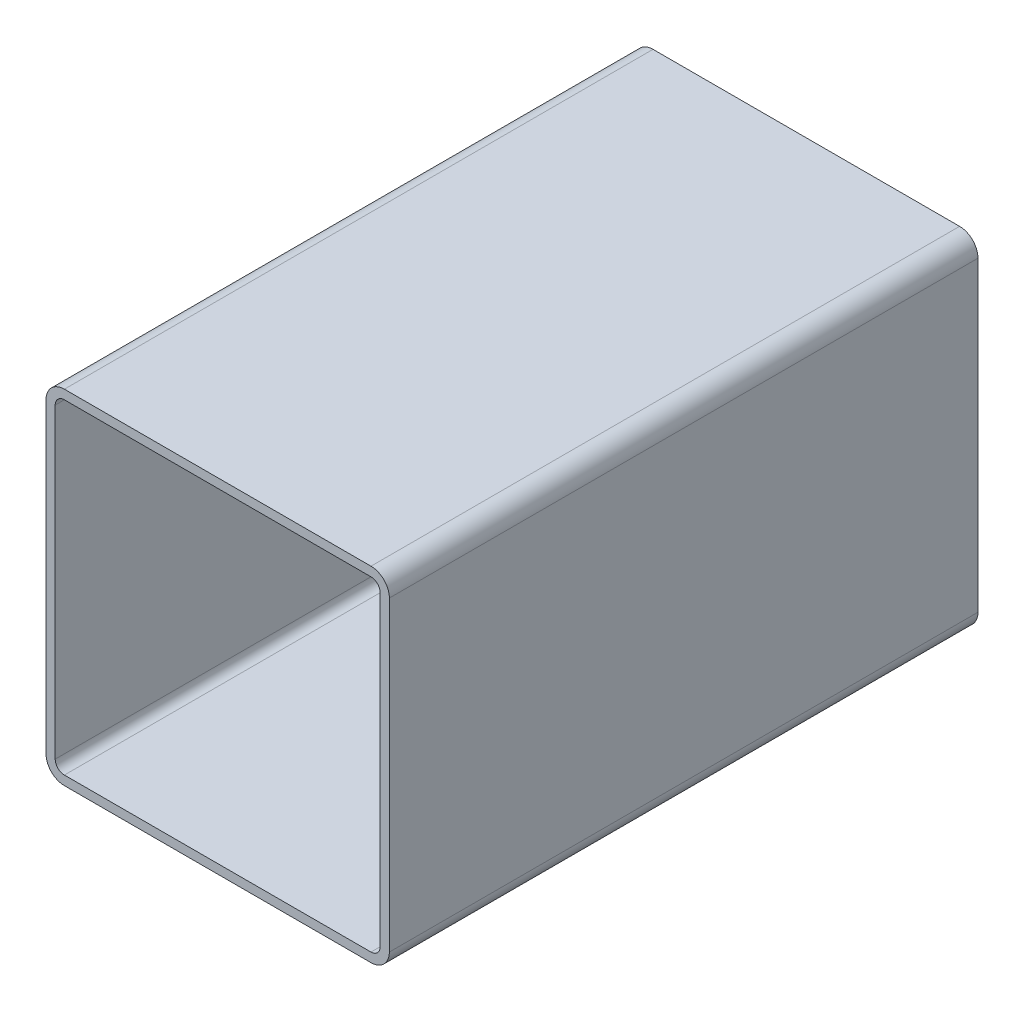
ISO-10303-21;
HEADER;
FILE_DESCRIPTION(('STEP AP214'),'2;1');
FILE_NAME('part.step','',(''),(''),'','','');
FILE_SCHEMA(('AUTOMOTIVE_DESIGN { 1 0 10303 214 1 1 1 1 }'));
ENDSEC;
DATA;
#1=APPLICATION_CONTEXT('core data for automotive mechanical design processes');
#2=APPLICATION_PROTOCOL_DEFINITION('international standard','automotive_design',2000,#1);
#3=PRODUCT_CONTEXT('',#1,'mechanical');
#4=PRODUCT('Part','Part','',(#3));
#5=PRODUCT_RELATED_PRODUCT_CATEGORY('part','',(#4));
#6=PRODUCT_DEFINITION_FORMATION('','',#4);
#7=PRODUCT_DEFINITION_CONTEXT('part definition',#1,'design');
#8=PRODUCT_DEFINITION('design','',#6,#7);
#9=PRODUCT_DEFINITION_SHAPE('','',#8);
#10=(LENGTH_UNIT() NAMED_UNIT(*) SI_UNIT(.MILLI.,.METRE.));
#11=(NAMED_UNIT(*) PLANE_ANGLE_UNIT() SI_UNIT($,.RADIAN.));
#12=(NAMED_UNIT(*) SI_UNIT($,.STERADIAN.) SOLID_ANGLE_UNIT());
#13=UNCERTAINTY_MEASURE_WITH_UNIT(LENGTH_MEASURE(1.E-05),#10,'distance_accuracy_value','');
#14=(GEOMETRIC_REPRESENTATION_CONTEXT(3) GLOBAL_UNCERTAINTY_ASSIGNED_CONTEXT((#13)) GLOBAL_UNIT_ASSIGNED_CONTEXT((#10,
#11,#12)) REPRESENTATION_CONTEXT('',''));
#15=CARTESIAN_POINT('',(0.,0.,0.));
#16=DIRECTION('',(0.,0.,1.));
#17=DIRECTION('',(1.,0.,0.));
#18=AXIS2_PLACEMENT_3D('',#15,#16,#17);
#19=CARTESIAN_POINT('',(11.7298786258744,170.264039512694,304.8));
#20=DIRECTION('',(0.,0.,1.));
#21=DIRECTION('',(1.,0.,0.));
#22=AXIS2_PLACEMENT_3D('',#19,#20,#21);
#23=PLANE('',#22);
#24=CARTESIAN_POINT('',(11.7298786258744,170.264039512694,304.8));
#25=DIRECTION('',(0.,0.,1.));
#26=DIRECTION('',(1.,0.,0.));
#27=AXIS2_PLACEMENT_3D('',#24,#25,#26);
#28=CIRCLE('',#27,9.525);
#29=CARTESIAN_POINT('',(11.7298786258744,179.789039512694,304.8));
#30=VERTEX_POINT('',#29);
#31=CARTESIAN_POINT('',(2.20487862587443,170.264039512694,304.8));
#32=VERTEX_POINT('',#31);
#33=EDGE_CURVE('E211',#30,#32,#28,.T.);
#34=ORIENTED_EDGE('',*,*,#33,.T.);
#35=DIRECTION('',(0.,-1.,0.));
#36=VECTOR('',#35,1.);
#37=CARTESIAN_POINT('',(2.20487862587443,11.5140395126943,304.8));
#38=LINE('',#37,#36);
#39=CARTESIAN_POINT('',(2.20487862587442,11.5140395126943,304.8));
#40=VERTEX_POINT('',#39);
#41=EDGE_CURVE('E214',#32,#40,#38,.T.);
#42=ORIENTED_EDGE('',*,*,#41,.T.);
#43=CARTESIAN_POINT('',(11.7298786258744,11.5140395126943,304.8));
#44=DIRECTION('',(0.,0.,1.));
#45=DIRECTION('',(1.,0.,0.));
#46=AXIS2_PLACEMENT_3D('',#43,#44,#45);
#47=CIRCLE('',#46,9.525);
#48=CARTESIAN_POINT('',(11.7298786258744,1.98903951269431,304.8));
#49=VERTEX_POINT('',#48);
#50=EDGE_CURVE('E217',#40,#49,#47,.T.);
#51=ORIENTED_EDGE('',*,*,#50,.T.);
#52=DIRECTION('',(1.,0.,0.));
#53=VECTOR('',#52,1.);
#54=CARTESIAN_POINT('',(170.479878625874,1.98903951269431,304.8));
#55=LINE('',#54,#53);
#56=CARTESIAN_POINT('',(170.479878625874,1.98903951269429,304.8));
#57=VERTEX_POINT('',#56);
#58=EDGE_CURVE('E219',#49,#57,#55,.T.);
#59=ORIENTED_EDGE('',*,*,#58,.T.);
#60=CARTESIAN_POINT('',(170.479878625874,11.5140395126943,304.8));
#61=DIRECTION('',(0.,0.,1.));
#62=DIRECTION('',(1.,0.,0.));
#63=AXIS2_PLACEMENT_3D('',#60,#61,#62);
#64=CIRCLE('',#63,9.52500000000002);
#65=CARTESIAN_POINT('',(180.004878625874,11.5140395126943,304.8));
#66=VERTEX_POINT('',#65);
#67=EDGE_CURVE('E221',#57,#66,#64,.T.);
#68=ORIENTED_EDGE('',*,*,#67,.T.);
#69=DIRECTION('',(0.,1.,0.));
#70=VECTOR('',#69,1.);
#71=CARTESIAN_POINT('',(180.004878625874,170.264039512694,304.8));
#72=LINE('',#71,#70);
#73=CARTESIAN_POINT('',(180.004878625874,170.264039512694,304.8));
#74=VERTEX_POINT('',#73);
#75=EDGE_CURVE('E223',#66,#74,#72,.T.);
#76=ORIENTED_EDGE('',*,*,#75,.T.);
#77=CARTESIAN_POINT('',(170.479878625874,170.264039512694,304.8));
#78=DIRECTION('',(0.,0.,1.));
#79=DIRECTION('',(1.,0.,0.));
#80=AXIS2_PLACEMENT_3D('',#77,#78,#79);
#81=CIRCLE('',#80,9.52500000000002);
#82=CARTESIAN_POINT('',(170.479878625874,179.789039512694,304.8));
#83=VERTEX_POINT('',#82);
#84=EDGE_CURVE('E225',#74,#83,#81,.T.);
#85=ORIENTED_EDGE('',*,*,#84,.T.);
#86=DIRECTION('',(-1.,0.,0.));
#87=VECTOR('',#86,1.);
#88=CARTESIAN_POINT('',(11.7298786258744,179.789039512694,304.8));
#89=LINE('',#88,#87);
#90=EDGE_CURVE('E227',#83,#30,#89,.T.);
#91=ORIENTED_EDGE('',*,*,#90,.T.);
#92=EDGE_LOOP('',(#34,#42,#51,#59,#68,#76,#85,#91));
#93=FACE_BOUND('',#92,.T.);
#94=DIRECTION('',(0.,-1.,0.));
#95=VECTOR('',#94,1.);
#96=CARTESIAN_POINT('',(6.96737862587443,11.5140395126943,304.8));
#97=LINE('',#96,#95);
#98=CARTESIAN_POINT('',(6.96737862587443,170.264039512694,304.8));
#99=VERTEX_POINT('',#98);
#100=CARTESIAN_POINT('',(6.96737862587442,11.5140395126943,304.8));
#101=VERTEX_POINT('',#100);
#102=EDGE_CURVE('E154',#99,#101,#97,.T.);
#103=ORIENTED_EDGE('',*,*,#102,.F.);
#104=CARTESIAN_POINT('',(11.7298786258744,170.264039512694,304.8));
#105=DIRECTION('',(0.,0.,1.));
#106=DIRECTION('',(1.,0.,0.));
#107=AXIS2_PLACEMENT_3D('',#104,#105,#106);
#108=CIRCLE('',#107,4.7625);
#109=CARTESIAN_POINT('',(11.7298786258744,175.026539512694,304.8));
#110=VERTEX_POINT('',#109);
#111=EDGE_CURVE('E146',#110,#99,#108,.T.);
#112=ORIENTED_EDGE('',*,*,#111,.F.);
#113=DIRECTION('',(-1.,0.,0.));
#114=VECTOR('',#113,1.);
#115=CARTESIAN_POINT('',(11.7298786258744,175.026539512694,304.8));
#116=LINE('',#115,#114);
#117=CARTESIAN_POINT('',(170.479878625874,175.026539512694,304.8));
#118=VERTEX_POINT('',#117);
#119=EDGE_CURVE('E179',#118,#110,#116,.T.);
#120=ORIENTED_EDGE('',*,*,#119,.F.);
#121=CARTESIAN_POINT('',(170.479878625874,170.264039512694,304.8));
#122=DIRECTION('',(0.,0.,1.));
#123=DIRECTION('',(1.,0.,0.));
#124=AXIS2_PLACEMENT_3D('',#121,#122,#123);
#125=CIRCLE('',#124,4.7625);
#126=CARTESIAN_POINT('',(175.242378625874,170.264039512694,304.8));
#127=VERTEX_POINT('',#126);
#128=EDGE_CURVE('E177',#127,#118,#125,.T.);
#129=ORIENTED_EDGE('',*,*,#128,.F.);
#130=DIRECTION('',(0.,1.,0.));
#131=VECTOR('',#130,1.);
#132=CARTESIAN_POINT('',(175.242378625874,170.264039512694,304.8));
#133=LINE('',#132,#131);
#134=CARTESIAN_POINT('',(175.242378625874,11.5140395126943,304.8));
#135=VERTEX_POINT('',#134);
#136=EDGE_CURVE('E175',#135,#127,#133,.T.);
#137=ORIENTED_EDGE('',*,*,#136,.F.);
#138=CARTESIAN_POINT('',(170.479878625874,11.5140395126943,304.8));
#139=DIRECTION('',(0.,0.,1.));
#140=DIRECTION('',(1.,0.,0.));
#141=AXIS2_PLACEMENT_3D('',#138,#139,#140);
#142=CIRCLE('',#141,4.7625);
#143=CARTESIAN_POINT('',(170.479878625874,6.75153951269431,304.8));
#144=VERTEX_POINT('',#143);
#145=EDGE_CURVE('E173',#144,#135,#142,.T.);
#146=ORIENTED_EDGE('',*,*,#145,.F.);
#147=DIRECTION('',(1.,0.,0.));
#148=VECTOR('',#147,1.);
#149=CARTESIAN_POINT('',(170.479878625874,6.75153951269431,304.8));
#150=LINE('',#149,#148);
#151=CARTESIAN_POINT('',(11.7298786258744,6.75153951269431,304.8));
#152=VERTEX_POINT('',#151);
#153=EDGE_CURVE('E169',#152,#144,#150,.T.);
#154=ORIENTED_EDGE('',*,*,#153,.F.);
#155=CARTESIAN_POINT('',(11.7298786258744,11.5140395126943,304.8));
#156=DIRECTION('',(0.,0.,1.));
#157=DIRECTION('',(1.,0.,0.));
#158=AXIS2_PLACEMENT_3D('',#155,#156,#157);
#159=CIRCLE('',#158,4.7625);
#160=EDGE_CURVE('E167',#101,#152,#159,.T.);
#161=ORIENTED_EDGE('',*,*,#160,.F.);
#162=EDGE_LOOP('',(#103,#112,#120,#129,#137,#146,#154,#161));
#163=FACE_BOUND('',#162,.T.);
#164=ADVANCED_FACE('F33',(#93,#163),#23,.T.);
#165=CARTESIAN_POINT('',(11.7298786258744,170.264039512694,0.));
#166=DIRECTION('',(0.,0.,1.));
#167=DIRECTION('',(1.,0.,0.));
#168=AXIS2_PLACEMENT_3D('',#165,#166,#167);
#169=PLANE('',#168);
#170=CARTESIAN_POINT('',(11.7298786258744,170.264039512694,0.));
#171=DIRECTION('',(0.,0.,1.));
#172=DIRECTION('',(1.,0.,0.));
#173=AXIS2_PLACEMENT_3D('',#170,#171,#172);
#174=CIRCLE('',#173,9.525);
#175=CARTESIAN_POINT('',(11.7298786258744,179.789039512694,0.));
#176=VERTEX_POINT('',#175);
#177=CARTESIAN_POINT('',(2.20487862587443,170.264039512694,0.));
#178=VERTEX_POINT('',#177);
#179=EDGE_CURVE('E162',#176,#178,#174,.T.);
#180=ORIENTED_EDGE('',*,*,#179,.F.);
#181=DIRECTION('',(-1.,0.,0.));
#182=VECTOR('',#181,1.);
#183=CARTESIAN_POINT('',(11.7298786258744,179.789039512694,0.));
#184=LINE('',#183,#182);
#185=CARTESIAN_POINT('',(170.479878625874,179.789039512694,0.));
#186=VERTEX_POINT('',#185);
#187=EDGE_CURVE('E215',#186,#176,#184,.T.);
#188=ORIENTED_EDGE('',*,*,#187,.F.);
#189=CARTESIAN_POINT('',(170.479878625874,170.264039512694,0.));
#190=DIRECTION('',(0.,0.,1.));
#191=DIRECTION('',(1.,0.,0.));
#192=AXIS2_PLACEMENT_3D('',#189,#190,#191);
#193=CIRCLE('',#192,9.52500000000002);
#194=CARTESIAN_POINT('',(180.004878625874,170.264039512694,0.));
#195=VERTEX_POINT('',#194);
#196=EDGE_CURVE('E242',#195,#186,#193,.T.);
#197=ORIENTED_EDGE('',*,*,#196,.F.);
#198=DIRECTION('',(0.,1.,0.));
#199=VECTOR('',#198,1.);
#200=CARTESIAN_POINT('',(180.004878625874,170.264039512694,0.));
#201=LINE('',#200,#199);
#202=CARTESIAN_POINT('',(180.004878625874,11.5140395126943,0.));
#203=VERTEX_POINT('',#202);
#204=EDGE_CURVE('E240',#203,#195,#201,.T.);
#205=ORIENTED_EDGE('',*,*,#204,.F.);
#206=CARTESIAN_POINT('',(170.479878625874,11.5140395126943,0.));
#207=DIRECTION('',(0.,0.,1.));
#208=DIRECTION('',(1.,0.,0.));
#209=AXIS2_PLACEMENT_3D('',#206,#207,#208);
#210=CIRCLE('',#209,9.52500000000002);
#211=CARTESIAN_POINT('',(170.479878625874,1.98903951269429,0.));
#212=VERTEX_POINT('',#211);
#213=EDGE_CURVE('E238',#212,#203,#210,.T.);
#214=ORIENTED_EDGE('',*,*,#213,.F.);
#215=DIRECTION('',(1.,0.,0.));
#216=VECTOR('',#215,1.);
#217=CARTESIAN_POINT('',(170.479878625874,1.98903951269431,0.));
#218=LINE('',#217,#216);
#219=CARTESIAN_POINT('',(11.7298786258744,1.98903951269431,0.));
#220=VERTEX_POINT('',#219);
#221=EDGE_CURVE('E236',#220,#212,#218,.T.);
#222=ORIENTED_EDGE('',*,*,#221,.F.);
#223=CARTESIAN_POINT('',(11.7298786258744,11.5140395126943,0.));
#224=DIRECTION('',(0.,0.,1.));
#225=DIRECTION('',(1.,0.,0.));
#226=AXIS2_PLACEMENT_3D('',#223,#224,#225);
#227=CIRCLE('',#226,9.525);
#228=CARTESIAN_POINT('',(2.20487862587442,11.5140395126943,0.));
#229=VERTEX_POINT('',#228);
#230=EDGE_CURVE('E234',#229,#220,#227,.T.);
#231=ORIENTED_EDGE('',*,*,#230,.F.);
#232=DIRECTION('',(0.,-1.,0.));
#233=VECTOR('',#232,1.);
#234=CARTESIAN_POINT('',(2.20487862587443,11.5140395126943,0.));
#235=LINE('',#234,#233);
#236=EDGE_CURVE('E232',#178,#229,#235,.T.);
#237=ORIENTED_EDGE('',*,*,#236,.F.);
#238=EDGE_LOOP('',(#180,#188,#197,#205,#214,#222,#231,#237));
#239=FACE_BOUND('',#238,.T.);
#240=CARTESIAN_POINT('',(11.7298786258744,170.264039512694,0.));
#241=DIRECTION('',(0.,0.,1.));
#242=DIRECTION('',(1.,0.,0.));
#243=AXIS2_PLACEMENT_3D('',#240,#241,#242);
#244=CIRCLE('',#243,4.7625);
#245=CARTESIAN_POINT('',(11.7298786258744,175.026539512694,0.));
#246=VERTEX_POINT('',#245);
#247=CARTESIAN_POINT('',(6.96737862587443,170.264039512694,0.));
#248=VERTEX_POINT('',#247);
#249=EDGE_CURVE('E56',#246,#248,#244,.T.);
#250=ORIENTED_EDGE('',*,*,#249,.T.);
#251=DIRECTION('',(0.,-1.,0.));
#252=VECTOR('',#251,1.);
#253=CARTESIAN_POINT('',(6.96737862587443,11.5140395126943,0.));
#254=LINE('',#253,#252);
#255=CARTESIAN_POINT('',(6.96737862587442,11.5140395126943,0.));
#256=VERTEX_POINT('',#255);
#257=EDGE_CURVE('E161',#248,#256,#254,.T.);
#258=ORIENTED_EDGE('',*,*,#257,.T.);
#259=CARTESIAN_POINT('',(11.7298786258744,11.5140395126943,0.));
#260=DIRECTION('',(0.,0.,1.));
#261=DIRECTION('',(1.,0.,0.));
#262=AXIS2_PLACEMENT_3D('',#259,#260,#261);
#263=CIRCLE('',#262,4.7625);
#264=CARTESIAN_POINT('',(11.7298786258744,6.75153951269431,0.));
#265=VERTEX_POINT('',#264);
#266=EDGE_CURVE('E183',#256,#265,#263,.T.);
#267=ORIENTED_EDGE('',*,*,#266,.T.);
#268=DIRECTION('',(1.,0.,0.));
#269=VECTOR('',#268,1.);
#270=CARTESIAN_POINT('',(170.479878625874,6.75153951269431,0.));
#271=LINE('',#270,#269);
#272=CARTESIAN_POINT('',(170.479878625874,6.75153951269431,0.));
#273=VERTEX_POINT('',#272);
#274=EDGE_CURVE('E186',#265,#273,#271,.T.);
#275=ORIENTED_EDGE('',*,*,#274,.T.);
#276=CARTESIAN_POINT('',(170.479878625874,11.5140395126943,0.));
#277=DIRECTION('',(0.,0.,1.));
#278=DIRECTION('',(1.,0.,0.));
#279=AXIS2_PLACEMENT_3D('',#276,#277,#278);
#280=CIRCLE('',#279,4.7625);
#281=CARTESIAN_POINT('',(175.242378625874,11.5140395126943,0.));
#282=VERTEX_POINT('',#281);
#283=EDGE_CURVE('E189',#273,#282,#280,.T.);
#284=ORIENTED_EDGE('',*,*,#283,.T.);
#285=DIRECTION('',(0.,1.,0.));
#286=VECTOR('',#285,1.);
#287=CARTESIAN_POINT('',(175.242378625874,170.264039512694,0.));
#288=LINE('',#287,#286);
#289=CARTESIAN_POINT('',(175.242378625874,170.264039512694,0.));
#290=VERTEX_POINT('',#289);
#291=EDGE_CURVE('E192',#282,#290,#288,.T.);
#292=ORIENTED_EDGE('',*,*,#291,.T.);
#293=CARTESIAN_POINT('',(170.479878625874,170.264039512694,0.));
#294=DIRECTION('',(0.,0.,1.));
#295=DIRECTION('',(1.,0.,0.));
#296=AXIS2_PLACEMENT_3D('',#293,#294,#295);
#297=CIRCLE('',#296,4.7625);
#298=CARTESIAN_POINT('',(170.479878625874,175.026539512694,0.));
#299=VERTEX_POINT('',#298);
#300=EDGE_CURVE('E195',#290,#299,#297,.T.);
#301=ORIENTED_EDGE('',*,*,#300,.T.);
#302=DIRECTION('',(-1.,0.,0.));
#303=VECTOR('',#302,1.);
#304=CARTESIAN_POINT('',(11.7298786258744,175.026539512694,0.));
#305=LINE('',#304,#303);
#306=EDGE_CURVE('E155',#299,#246,#305,.T.);
#307=ORIENTED_EDGE('',*,*,#306,.T.);
#308=EDGE_LOOP('',(#250,#258,#267,#275,#284,#292,#301,#307));
#309=FACE_BOUND('',#308,.T.);
#310=ADVANCED_FACE('F272',(#239,#309),#169,.F.);
#311=CARTESIAN_POINT('',(11.7298786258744,170.264039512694,304.8));
#312=DIRECTION('',(0.,0.,-1.));
#313=DIRECTION('',(-1.,0.,0.));
#314=AXIS2_PLACEMENT_3D('',#311,#312,#313);
#315=CYLINDRICAL_SURFACE('',#314,9.525);
#316=ORIENTED_EDGE('',*,*,#179,.T.);
#317=DIRECTION('',(0.,0.,-1.));
#318=VECTOR('',#317,1.);
#319=CARTESIAN_POINT('',(2.20487862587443,170.264039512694,304.8));
#320=LINE('',#319,#318);
#321=EDGE_CURVE('E11',#32,#178,#320,.T.);
#322=ORIENTED_EDGE('',*,*,#321,.F.);
#323=ORIENTED_EDGE('',*,*,#33,.F.);
#324=DIRECTION('',(0.,0.,-1.));
#325=VECTOR('',#324,1.);
#326=CARTESIAN_POINT('',(11.7298786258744,179.789039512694,304.8));
#327=LINE('',#326,#325);
#328=EDGE_CURVE('E229',#30,#176,#327,.T.);
#329=ORIENTED_EDGE('',*,*,#328,.T.);
#330=EDGE_LOOP('',(#316,#322,#323,#329));
#331=FACE_BOUND('',#330,.T.);
#332=ADVANCED_FACE('F35',(#331),#315,.T.);
#333=CARTESIAN_POINT('',(2.20487862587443,11.5140395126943,304.8));
#334=DIRECTION('',(1.,0.,0.));
#335=DIRECTION('',(0.,0.,-1.));
#336=AXIS2_PLACEMENT_3D('',#333,#334,#335);
#337=PLANE('',#336);
#338=ORIENTED_EDGE('',*,*,#236,.T.);
#339=DIRECTION('',(0.,0.,-1.));
#340=VECTOR('',#339,1.);
#341=CARTESIAN_POINT('',(2.20487862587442,11.5140395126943,304.8));
#342=LINE('',#341,#340);
#343=EDGE_CURVE('E41',#40,#229,#342,.T.);
#344=ORIENTED_EDGE('',*,*,#343,.F.);
#345=ORIENTED_EDGE('',*,*,#41,.F.);
#346=ORIENTED_EDGE('',*,*,#321,.T.);
#347=EDGE_LOOP('',(#338,#344,#345,#346));
#348=FACE_BOUND('',#347,.T.);
#349=ADVANCED_FACE('F289',(#348),#337,.F.);
#350=CARTESIAN_POINT('',(11.7298786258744,11.5140395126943,304.8));
#351=DIRECTION('',(0.,0.,-1.));
#352=DIRECTION('',(-1.,0.,0.));
#353=AXIS2_PLACEMENT_3D('',#350,#351,#352);
#354=CYLINDRICAL_SURFACE('',#353,9.525);
#355=ORIENTED_EDGE('',*,*,#230,.T.);
#356=DIRECTION('',(0.,0.,-1.));
#357=VECTOR('',#356,1.);
#358=CARTESIAN_POINT('',(11.7298786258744,1.98903951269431,304.8));
#359=LINE('',#358,#357);
#360=EDGE_CURVE('E259',#49,#220,#359,.T.);
#361=ORIENTED_EDGE('',*,*,#360,.F.);
#362=ORIENTED_EDGE('',*,*,#50,.F.);
#363=ORIENTED_EDGE('',*,*,#343,.T.);
#364=EDGE_LOOP('',(#355,#361,#362,#363));
#365=FACE_BOUND('',#364,.T.);
#366=ADVANCED_FACE('F266',(#365),#354,.T.);
#367=CARTESIAN_POINT('',(170.479878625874,1.98903951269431,304.8));
#368=DIRECTION('',(0.,1.,0.));
#369=DIRECTION('',(0.,0.,1.));
#370=AXIS2_PLACEMENT_3D('',#367,#368,#369);
#371=PLANE('',#370);
#372=ORIENTED_EDGE('',*,*,#221,.T.);
#373=DIRECTION('',(0.,0.,-1.));
#374=VECTOR('',#373,1.);
#375=CARTESIAN_POINT('',(170.479878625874,1.98903951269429,304.8));
#376=LINE('',#375,#374);
#377=EDGE_CURVE('E256',#57,#212,#376,.T.);
#378=ORIENTED_EDGE('',*,*,#377,.F.);
#379=ORIENTED_EDGE('',*,*,#58,.F.);
#380=ORIENTED_EDGE('',*,*,#360,.T.);
#381=EDGE_LOOP('',(#372,#378,#379,#380));
#382=FACE_BOUND('',#381,.T.);
#383=ADVANCED_FACE('F278',(#382),#371,.F.);
#384=CARTESIAN_POINT('',(170.479878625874,11.5140395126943,304.8));
#385=DIRECTION('',(0.,0.,-1.));
#386=DIRECTION('',(-1.,0.,0.));
#387=AXIS2_PLACEMENT_3D('',#384,#385,#386);
#388=CYLINDRICAL_SURFACE('',#387,9.52500000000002);
#389=ORIENTED_EDGE('',*,*,#213,.T.);
#390=DIRECTION('',(0.,0.,-1.));
#391=VECTOR('',#390,1.);
#392=CARTESIAN_POINT('',(180.004878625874,11.5140395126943,304.8));
#393=LINE('',#392,#391);
#394=EDGE_CURVE('E253',#66,#203,#393,.T.);
#395=ORIENTED_EDGE('',*,*,#394,.F.);
#396=ORIENTED_EDGE('',*,*,#67,.F.);
#397=ORIENTED_EDGE('',*,*,#377,.T.);
#398=EDGE_LOOP('',(#389,#395,#396,#397));
#399=FACE_BOUND('',#398,.T.);
#400=ADVANCED_FACE('F282',(#399),#388,.T.);
#401=CARTESIAN_POINT('',(180.004878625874,170.264039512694,304.8));
#402=DIRECTION('',(-1.,0.,0.));
#403=DIRECTION('',(0.,0.,1.));
#404=AXIS2_PLACEMENT_3D('',#401,#402,#403);
#405=PLANE('',#404);
#406=ORIENTED_EDGE('',*,*,#204,.T.);
#407=DIRECTION('',(0.,0.,-1.));
#408=VECTOR('',#407,1.);
#409=CARTESIAN_POINT('',(180.004878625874,170.264039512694,304.8));
#410=LINE('',#409,#408);
#411=EDGE_CURVE('E250',#74,#195,#410,.T.);
#412=ORIENTED_EDGE('',*,*,#411,.F.);
#413=ORIENTED_EDGE('',*,*,#75,.F.);
#414=ORIENTED_EDGE('',*,*,#394,.T.);
#415=EDGE_LOOP('',(#406,#412,#413,#414));
#416=FACE_BOUND('',#415,.T.);
#417=ADVANCED_FACE('F302',(#416),#405,.F.);
#418=CARTESIAN_POINT('',(170.479878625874,170.264039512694,304.8));
#419=DIRECTION('',(0.,0.,-1.));
#420=DIRECTION('',(-1.,0.,0.));
#421=AXIS2_PLACEMENT_3D('',#418,#419,#420);
#422=CYLINDRICAL_SURFACE('',#421,9.52500000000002);
#423=ORIENTED_EDGE('',*,*,#196,.T.);
#424=DIRECTION('',(0.,0.,-1.));
#425=VECTOR('',#424,1.);
#426=CARTESIAN_POINT('',(170.479878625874,179.789039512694,304.8));
#427=LINE('',#426,#425);
#428=EDGE_CURVE('E247',#83,#186,#427,.T.);
#429=ORIENTED_EDGE('',*,*,#428,.F.);
#430=ORIENTED_EDGE('',*,*,#84,.F.);
#431=ORIENTED_EDGE('',*,*,#411,.T.);
#432=EDGE_LOOP('',(#423,#429,#430,#431));
#433=FACE_BOUND('',#432,.T.);
#434=ADVANCED_FACE('F300',(#433),#422,.T.);
#435=CARTESIAN_POINT('',(11.7298786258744,179.789039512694,304.8));
#436=DIRECTION('',(0.,-1.,0.));
#437=DIRECTION('',(0.,0.,-1.));
#438=AXIS2_PLACEMENT_3D('',#435,#436,#437);
#439=PLANE('',#438);
#440=ORIENTED_EDGE('',*,*,#187,.T.);
#441=ORIENTED_EDGE('',*,*,#328,.F.);
#442=ORIENTED_EDGE('',*,*,#90,.F.);
#443=ORIENTED_EDGE('',*,*,#428,.T.);
#444=EDGE_LOOP('',(#440,#441,#442,#443));
#445=FACE_BOUND('',#444,.T.);
#446=ADVANCED_FACE('F295',(#445),#439,.F.);
#447=CARTESIAN_POINT('',(11.7298786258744,170.264039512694,304.8));
#448=DIRECTION('',(0.,0.,-1.));
#449=DIRECTION('',(-1.,0.,0.));
#450=AXIS2_PLACEMENT_3D('',#447,#448,#449);
#451=CYLINDRICAL_SURFACE('',#450,4.7625);
#452=ORIENTED_EDGE('',*,*,#249,.F.);
#453=DIRECTION('',(0.,0.,-1.));
#454=VECTOR('',#453,1.);
#455=CARTESIAN_POINT('',(11.7298786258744,175.026539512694,304.8));
#456=LINE('',#455,#454);
#457=EDGE_CURVE('E150',#110,#246,#456,.T.);
#458=ORIENTED_EDGE('',*,*,#457,.F.);
#459=ORIENTED_EDGE('',*,*,#111,.T.);
#460=DIRECTION('',(0.,0.,-1.));
#461=VECTOR('',#460,1.);
#462=CARTESIAN_POINT('',(6.96737862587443,170.264039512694,304.8));
#463=LINE('',#462,#461);
#464=EDGE_CURVE('E149',#99,#248,#463,.T.);
#465=ORIENTED_EDGE('',*,*,#464,.T.);
#466=EDGE_LOOP('',(#452,#458,#459,#465));
#467=FACE_BOUND('',#466,.T.);
#468=ADVANCED_FACE('F148',(#467),#451,.F.);
#469=CARTESIAN_POINT('',(6.96737862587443,11.5140395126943,304.8));
#470=DIRECTION('',(1.,0.,0.));
#471=DIRECTION('',(0.,0.,-1.));
#472=AXIS2_PLACEMENT_3D('',#469,#470,#471);
#473=PLANE('',#472);
#474=ORIENTED_EDGE('',*,*,#257,.F.);
#475=ORIENTED_EDGE('',*,*,#464,.F.);
#476=ORIENTED_EDGE('',*,*,#102,.T.);
#477=DIRECTION('',(0.,0.,-1.));
#478=VECTOR('',#477,1.);
#479=CARTESIAN_POINT('',(6.96737862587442,11.5140395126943,304.8));
#480=LINE('',#479,#478);
#481=EDGE_CURVE('E163',#101,#256,#480,.T.);
#482=ORIENTED_EDGE('',*,*,#481,.T.);
#483=EDGE_LOOP('',(#474,#475,#476,#482));
#484=FACE_BOUND('',#483,.T.);
#485=ADVANCED_FACE('F158',(#484),#473,.T.);
#486=CARTESIAN_POINT('',(11.7298786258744,11.5140395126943,304.8));
#487=DIRECTION('',(0.,0.,-1.));
#488=DIRECTION('',(-1.,0.,0.));
#489=AXIS2_PLACEMENT_3D('',#486,#487,#488);
#490=CYLINDRICAL_SURFACE('',#489,4.7625);
#491=ORIENTED_EDGE('',*,*,#266,.F.);
#492=ORIENTED_EDGE('',*,*,#481,.F.);
#493=ORIENTED_EDGE('',*,*,#160,.T.);
#494=DIRECTION('',(0.,0.,-1.));
#495=VECTOR('',#494,1.);
#496=CARTESIAN_POINT('',(11.7298786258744,6.75153951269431,304.8));
#497=LINE('',#496,#495);
#498=EDGE_CURVE('E208',#152,#265,#497,.T.);
#499=ORIENTED_EDGE('',*,*,#498,.T.);
#500=EDGE_LOOP('',(#491,#492,#493,#499));
#501=FACE_BOUND('',#500,.T.);
#502=ADVANCED_FACE('F327',(#501),#490,.F.);
#503=CARTESIAN_POINT('',(170.479878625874,6.75153951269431,304.8));
#504=DIRECTION('',(0.,1.,0.));
#505=DIRECTION('',(0.,0.,1.));
#506=AXIS2_PLACEMENT_3D('',#503,#504,#505);
#507=PLANE('',#506);
#508=ORIENTED_EDGE('',*,*,#274,.F.);
#509=ORIENTED_EDGE('',*,*,#498,.F.);
#510=ORIENTED_EDGE('',*,*,#153,.T.);
#511=DIRECTION('',(0.,0.,-1.));
#512=VECTOR('',#511,1.);
#513=CARTESIAN_POINT('',(170.479878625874,6.75153951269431,304.8));
#514=LINE('',#513,#512);
#515=EDGE_CURVE('E206',#144,#273,#514,.T.);
#516=ORIENTED_EDGE('',*,*,#515,.T.);
#517=EDGE_LOOP('',(#508,#509,#510,#516));
#518=FACE_BOUND('',#517,.T.);
#519=ADVANCED_FACE('F331',(#518),#507,.T.);
#520=CARTESIAN_POINT('',(170.479878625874,11.5140395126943,304.8));
#521=DIRECTION('',(0.,0.,-1.));
#522=DIRECTION('',(-1.,0.,0.));
#523=AXIS2_PLACEMENT_3D('',#520,#521,#522);
#524=CYLINDRICAL_SURFACE('',#523,4.7625);
#525=ORIENTED_EDGE('',*,*,#283,.F.);
#526=ORIENTED_EDGE('',*,*,#515,.F.);
#527=ORIENTED_EDGE('',*,*,#145,.T.);
#528=DIRECTION('',(0.,0.,-1.));
#529=VECTOR('',#528,1.);
#530=CARTESIAN_POINT('',(175.242378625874,11.5140395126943,304.8));
#531=LINE('',#530,#529);
#532=EDGE_CURVE('E204',#135,#282,#531,.T.);
#533=ORIENTED_EDGE('',*,*,#532,.T.);
#534=EDGE_LOOP('',(#525,#526,#527,#533));
#535=FACE_BOUND('',#534,.T.);
#536=ADVANCED_FACE('F337',(#535),#524,.F.);
#537=CARTESIAN_POINT('',(175.242378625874,170.264039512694,304.8));
#538=DIRECTION('',(-1.,0.,0.));
#539=DIRECTION('',(0.,0.,1.));
#540=AXIS2_PLACEMENT_3D('',#537,#538,#539);
#541=PLANE('',#540);
#542=ORIENTED_EDGE('',*,*,#291,.F.);
#543=ORIENTED_EDGE('',*,*,#532,.F.);
#544=ORIENTED_EDGE('',*,*,#136,.T.);
#545=DIRECTION('',(0.,0.,-1.));
#546=VECTOR('',#545,1.);
#547=CARTESIAN_POINT('',(175.242378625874,170.264039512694,304.8));
#548=LINE('',#547,#546);
#549=EDGE_CURVE('E202',#127,#290,#548,.T.);
#550=ORIENTED_EDGE('',*,*,#549,.T.);
#551=EDGE_LOOP('',(#542,#543,#544,#550));
#552=FACE_BOUND('',#551,.T.);
#553=ADVANCED_FACE('F341',(#552),#541,.T.);
#554=CARTESIAN_POINT('',(170.479878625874,170.264039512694,304.8));
#555=DIRECTION('',(0.,0.,-1.));
#556=DIRECTION('',(-1.,0.,0.));
#557=AXIS2_PLACEMENT_3D('',#554,#555,#556);
#558=CYLINDRICAL_SURFACE('',#557,4.7625);
#559=ORIENTED_EDGE('',*,*,#300,.F.);
#560=ORIENTED_EDGE('',*,*,#549,.F.);
#561=ORIENTED_EDGE('',*,*,#128,.T.);
#562=DIRECTION('',(0.,0.,-1.));
#563=VECTOR('',#562,1.);
#564=CARTESIAN_POINT('',(170.479878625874,175.026539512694,304.8));
#565=LINE('',#564,#563);
#566=EDGE_CURVE('E48',#118,#299,#565,.T.);
#567=ORIENTED_EDGE('',*,*,#566,.T.);
#568=EDGE_LOOP('',(#559,#560,#561,#567));
#569=FACE_BOUND('',#568,.T.);
#570=ADVANCED_FACE('F345',(#569),#558,.F.);
#571=CARTESIAN_POINT('',(11.7298786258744,175.026539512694,304.8));
#572=DIRECTION('',(0.,-1.,0.));
#573=DIRECTION('',(0.,0.,-1.));
#574=AXIS2_PLACEMENT_3D('',#571,#572,#573);
#575=PLANE('',#574);
#576=ORIENTED_EDGE('',*,*,#306,.F.);
#577=ORIENTED_EDGE('',*,*,#566,.F.);
#578=ORIENTED_EDGE('',*,*,#119,.T.);
#579=ORIENTED_EDGE('',*,*,#457,.T.);
#580=EDGE_LOOP('',(#576,#577,#578,#579));
#581=FACE_BOUND('',#580,.T.);
#582=ADVANCED_FACE('F349',(#581),#575,.T.);
#583=CLOSED_SHELL('',(#164,#310,#332,#349,#366,#383,#400,#417,#434,#446,#468,#485,#502,#519,
#536,#553,#570,#582));
#584=MANIFOLD_SOLID_BREP('B2',#583);
#585=ADVANCED_BREP_SHAPE_REPRESENTATION('',(#18,#584),#14);
#586=SHAPE_DEFINITION_REPRESENTATION(#9,#585);
ENDSEC;
END-ISO-10303-21;
